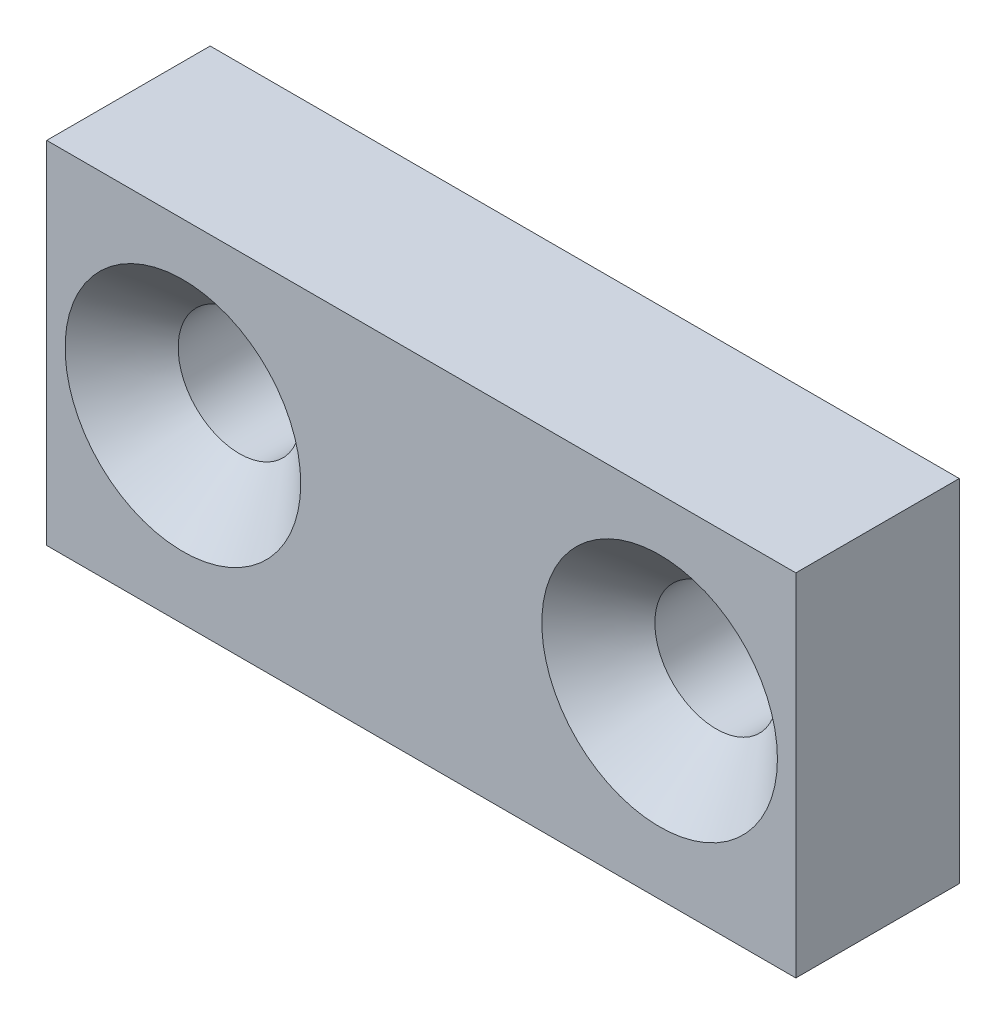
ISO-10303-21;
HEADER;
FILE_DESCRIPTION(('STEP AP214'),'2;1');
FILE_NAME('part.step','',(''),(''),'','','');
FILE_SCHEMA(('AUTOMOTIVE_DESIGN { 1 0 10303 214 1 1 1 1 }'));
ENDSEC;
DATA;
#1=APPLICATION_CONTEXT('core data for automotive mechanical design processes');
#2=APPLICATION_PROTOCOL_DEFINITION('international standard','automotive_design',2000,#1);
#3=PRODUCT_CONTEXT('',#1,'mechanical');
#4=PRODUCT('Part','Part','',(#3));
#5=PRODUCT_RELATED_PRODUCT_CATEGORY('part','',(#4));
#6=PRODUCT_DEFINITION_FORMATION('','',#4);
#7=PRODUCT_DEFINITION_CONTEXT('part definition',#1,'design');
#8=PRODUCT_DEFINITION('design','',#6,#7);
#9=PRODUCT_DEFINITION_SHAPE('','',#8);
#10=(LENGTH_UNIT() NAMED_UNIT(*) SI_UNIT(.MILLI.,.METRE.));
#11=(NAMED_UNIT(*) PLANE_ANGLE_UNIT() SI_UNIT($,.RADIAN.));
#12=(NAMED_UNIT(*) SI_UNIT($,.STERADIAN.) SOLID_ANGLE_UNIT());
#13=UNCERTAINTY_MEASURE_WITH_UNIT(LENGTH_MEASURE(1.E-05),#10,'distance_accuracy_value','');
#14=(GEOMETRIC_REPRESENTATION_CONTEXT(3) GLOBAL_UNCERTAINTY_ASSIGNED_CONTEXT((#13)) GLOBAL_UNIT_ASSIGNED_CONTEXT((#10,
#11,#12)) REPRESENTATION_CONTEXT('',''));
#15=CARTESIAN_POINT('',(0.,0.,0.));
#16=DIRECTION('',(0.,0.,1.));
#17=DIRECTION('',(1.,0.,0.));
#18=AXIS2_PLACEMENT_3D('',#15,#16,#17);
#19=CARTESIAN_POINT('',(-598.,0.,72.7336611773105));
#20=DIRECTION('',(1.,0.,0.));
#21=DIRECTION('',(0.,0.,-1.));
#22=AXIS2_PLACEMENT_3D('',#19,#20,#21);
#23=PLANE('',#22);
#24=DIRECTION('',(0.,-1.,0.));
#25=VECTOR('',#24,1.);
#26=CARTESIAN_POINT('',(-598.,0.,12.0000000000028));
#27=LINE('',#26,#25);
#28=CARTESIAN_POINT('',(-598.,25.76,12.0000000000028));
#29=VERTEX_POINT('',#28);
#30=CARTESIAN_POINT('',(-598.,0.,12.0000000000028));
#31=VERTEX_POINT('',#30);
#32=EDGE_CURVE('E81',#29,#31,#27,.T.);
#33=ORIENTED_EDGE('',*,*,#32,.F.);
#34=DIRECTION('',(0.,0.,-1.));
#35=VECTOR('',#34,1.);
#36=CARTESIAN_POINT('',(-598.,25.76,72.7336611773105));
#37=LINE('',#36,#35);
#38=CARTESIAN_POINT('',(-598.,25.76,0.));
#39=VERTEX_POINT('',#38);
#40=EDGE_CURVE('E35',#29,#39,#37,.T.);
#41=ORIENTED_EDGE('',*,*,#40,.T.);
#42=DIRECTION('',(0.,-1.,0.));
#43=VECTOR('',#42,1.);
#44=CARTESIAN_POINT('',(-598.,0.,0.));
#45=LINE('',#44,#43);
#46=CARTESIAN_POINT('',(-598.,0.,0.));
#47=VERTEX_POINT('',#46);
#48=EDGE_CURVE('E79',#39,#47,#45,.T.);
#49=ORIENTED_EDGE('',*,*,#48,.T.);
#50=DIRECTION('',(0.,0.,-1.));
#51=VECTOR('',#50,1.);
#52=CARTESIAN_POINT('',(-598.,0.,72.7336611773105));
#53=LINE('',#52,#51);
#54=EDGE_CURVE('E70',#31,#47,#53,.T.);
#55=ORIENTED_EDGE('',*,*,#54,.F.);
#56=EDGE_LOOP('',(#33,#41,#49,#55));
#57=FACE_BOUND('',#56,.T.);
#58=ADVANCED_FACE('F31',(#57),#23,.F.);
#59=CARTESIAN_POINT('',(-543.,0.,72.7336611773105));
#60=DIRECTION('',(0.,1.,0.));
#61=DIRECTION('',(-1.,0.,0.));
#62=AXIS2_PLACEMENT_3D('',#59,#60,#61);
#63=PLANE('',#62);
#64=DIRECTION('',(1.,0.,0.));
#65=VECTOR('',#64,1.);
#66=CARTESIAN_POINT('',(-543.,0.,12.0000000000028));
#67=LINE('',#66,#65);
#68=CARTESIAN_POINT('',(-543.,0.,12.0000000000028));
#69=VERTEX_POINT('',#68);
#70=EDGE_CURVE('E40',#31,#69,#67,.T.);
#71=ORIENTED_EDGE('',*,*,#70,.F.);
#72=ORIENTED_EDGE('',*,*,#54,.T.);
#73=DIRECTION('',(1.,0.,0.));
#74=VECTOR('',#73,1.);
#75=CARTESIAN_POINT('',(-543.,0.,0.));
#76=LINE('',#75,#74);
#77=CARTESIAN_POINT('',(-543.,0.,0.));
#78=VERTEX_POINT('',#77);
#79=EDGE_CURVE('E92',#47,#78,#76,.T.);
#80=ORIENTED_EDGE('',*,*,#79,.T.);
#81=DIRECTION('',(0.,0.,-1.));
#82=VECTOR('',#81,1.);
#83=CARTESIAN_POINT('',(-543.,0.,72.7336611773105));
#84=LINE('',#83,#82);
#85=EDGE_CURVE('E101',#69,#78,#84,.T.);
#86=ORIENTED_EDGE('',*,*,#85,.F.);
#87=EDGE_LOOP('',(#71,#72,#80,#86));
#88=FACE_BOUND('',#87,.T.);
#89=ADVANCED_FACE('F144',(#88),#63,.F.);
#90=CARTESIAN_POINT('',(-543.,0.,72.7336611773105));
#91=DIRECTION('',(-1.,0.,0.));
#92=DIRECTION('',(0.,0.,1.));
#93=AXIS2_PLACEMENT_3D('',#90,#91,#92);
#94=PLANE('',#93);
#95=DIRECTION('',(0.,1.,0.));
#96=VECTOR('',#95,1.);
#97=CARTESIAN_POINT('',(-543.,0.,12.0000000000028));
#98=LINE('',#97,#96);
#99=CARTESIAN_POINT('',(-543.,25.76,12.0000000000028));
#100=VERTEX_POINT('',#99);
#101=EDGE_CURVE('E11',#69,#100,#98,.T.);
#102=ORIENTED_EDGE('',*,*,#101,.F.);
#103=ORIENTED_EDGE('',*,*,#85,.T.);
#104=DIRECTION('',(0.,1.,0.));
#105=VECTOR('',#104,1.);
#106=CARTESIAN_POINT('',(-543.,0.,0.));
#107=LINE('',#106,#105);
#108=CARTESIAN_POINT('',(-543.,25.76,0.));
#109=VERTEX_POINT('',#108);
#110=EDGE_CURVE('E102',#78,#109,#107,.T.);
#111=ORIENTED_EDGE('',*,*,#110,.T.);
#112=DIRECTION('',(0.,0.,-1.));
#113=VECTOR('',#112,1.);
#114=CARTESIAN_POINT('',(-543.,25.76,72.7336611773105));
#115=LINE('',#114,#113);
#116=EDGE_CURVE('E53',#100,#109,#115,.T.);
#117=ORIENTED_EDGE('',*,*,#116,.F.);
#118=EDGE_LOOP('',(#102,#103,#111,#117));
#119=FACE_BOUND('',#118,.T.);
#120=ADVANCED_FACE('F143',(#119),#94,.F.);
#121=CARTESIAN_POINT('',(-543.,25.76,72.7336611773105));
#122=DIRECTION('',(0.,-1.,0.));
#123=DIRECTION('',(0.,0.,-1.));
#124=AXIS2_PLACEMENT_3D('',#121,#122,#123);
#125=PLANE('',#124);
#126=DIRECTION('',(-1.,0.,0.));
#127=VECTOR('',#126,1.);
#128=CARTESIAN_POINT('',(-543.,25.76,12.0000000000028));
#129=LINE('',#128,#127);
#130=EDGE_CURVE('E89',#100,#29,#129,.T.);
#131=ORIENTED_EDGE('',*,*,#130,.F.);
#132=ORIENTED_EDGE('',*,*,#116,.T.);
#133=DIRECTION('',(-1.,0.,0.));
#134=VECTOR('',#133,1.);
#135=CARTESIAN_POINT('',(-543.,25.76,0.));
#136=LINE('',#135,#134);
#137=EDGE_CURVE('E85',#109,#39,#136,.T.);
#138=ORIENTED_EDGE('',*,*,#137,.T.);
#139=ORIENTED_EDGE('',*,*,#40,.F.);
#140=EDGE_LOOP('',(#131,#132,#138,#139));
#141=FACE_BOUND('',#140,.T.);
#142=ADVANCED_FACE('F86',(#141),#125,.F.);
#143=CARTESIAN_POINT('',(-598.,25.76,0.));
#144=DIRECTION('',(0.,0.,1.));
#145=DIRECTION('',(1.,0.,0.));
#146=AXIS2_PLACEMENT_3D('',#143,#144,#145);
#147=PLANE('',#146);
#148=CARTESIAN_POINT('',(-553.,13.26,0.));
#149=DIRECTION('',(0.,0.,1.));
#150=DIRECTION('',(1.,0.,0.));
#151=AXIS2_PLACEMENT_3D('',#148,#149,#150);
#152=CIRCLE('',#151,4.49999999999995);
#153=CARTESIAN_POINT('',(-548.5,13.26,0.));
#154=VERTEX_POINT('',#153);
#155=EDGE_CURVE('E119',#154,#154,#152,.T.);
#156=ORIENTED_EDGE('',*,*,#155,.T.);
#157=EDGE_LOOP('',(#156));
#158=FACE_BOUND('',#157,.T.);
#159=CARTESIAN_POINT('',(-588.,13.26,0.));
#160=DIRECTION('',(0.,0.,1.));
#161=DIRECTION('',(1.,0.,0.));
#162=AXIS2_PLACEMENT_3D('',#159,#160,#161);
#163=CIRCLE('',#162,4.49999999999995);
#164=CARTESIAN_POINT('',(-583.5,13.26,0.));
#165=VERTEX_POINT('',#164);
#166=EDGE_CURVE('E110',#165,#165,#163,.T.);
#167=ORIENTED_EDGE('',*,*,#166,.T.);
#168=EDGE_LOOP('',(#167));
#169=FACE_BOUND('',#168,.T.);
#170=ORIENTED_EDGE('',*,*,#48,.F.);
#171=ORIENTED_EDGE('',*,*,#137,.F.);
#172=ORIENTED_EDGE('',*,*,#110,.F.);
#173=ORIENTED_EDGE('',*,*,#79,.F.);
#174=EDGE_LOOP('',(#170,#171,#172,#173));
#175=FACE_BOUND('',#174,.T.);
#176=ADVANCED_FACE('F91',(#158,#169,#175),#147,.F.);
#177=CARTESIAN_POINT('',(-568.,3.64999999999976,12.0000000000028));
#178=DIRECTION('',(0.,0.,1.));
#179=DIRECTION('',(1.,0.,0.));
#180=AXIS2_PLACEMENT_3D('',#177,#178,#179);
#181=PLANE('',#180);
#182=CARTESIAN_POINT('',(-553.,13.26,12.0000000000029));
#183=DIRECTION('',(0.,0.,1.));
#184=DIRECTION('',(1.,0.,0.));
#185=AXIS2_PLACEMENT_3D('',#182,#183,#184);
#186=CIRCLE('',#185,8.65000000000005);
#187=CARTESIAN_POINT('',(-544.35,13.26,12.0000000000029));
#188=VERTEX_POINT('',#187);
#189=EDGE_CURVE('E113',#188,#188,#186,.T.);
#190=ORIENTED_EDGE('',*,*,#189,.F.);
#191=EDGE_LOOP('',(#190));
#192=FACE_BOUND('',#191,.T.);
#193=CARTESIAN_POINT('',(-588.,13.26,12.0000000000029));
#194=DIRECTION('',(0.,0.,1.));
#195=DIRECTION('',(1.,0.,0.));
#196=AXIS2_PLACEMENT_3D('',#193,#194,#195);
#197=CIRCLE('',#196,8.65000000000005);
#198=CARTESIAN_POINT('',(-579.35,13.26,12.0000000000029));
#199=VERTEX_POINT('',#198);
#200=EDGE_CURVE('E83',#199,#199,#197,.T.);
#201=ORIENTED_EDGE('',*,*,#200,.F.);
#202=EDGE_LOOP('',(#201));
#203=FACE_BOUND('',#202,.T.);
#204=ORIENTED_EDGE('',*,*,#130,.T.);
#205=ORIENTED_EDGE('',*,*,#32,.T.);
#206=ORIENTED_EDGE('',*,*,#70,.T.);
#207=ORIENTED_EDGE('',*,*,#101,.T.);
#208=EDGE_LOOP('',(#204,#205,#206,#207));
#209=FACE_BOUND('',#208,.T.);
#210=ADVANCED_FACE('F33',(#192,#203,#209),#181,.T.);
#211=CARTESIAN_POINT('',(-588.,13.26,12.0000000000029));
#212=DIRECTION('',(0.,0.,1.));
#213=DIRECTION('',(1.,0.,0.));
#214=AXIS2_PLACEMENT_3D('',#211,#212,#213);
#215=CONICAL_SURFACE('',#214,8.65000000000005,0.78539816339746);
#216=CARTESIAN_POINT('',(-588.,13.26,7.8500000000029));
#217=DIRECTION('',(0.,0.,1.));
#218=DIRECTION('',(1.,0.,0.));
#219=AXIS2_PLACEMENT_3D('',#216,#217,#218);
#220=CIRCLE('',#219,4.49999999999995);
#221=CARTESIAN_POINT('',(-583.5,13.26,7.8500000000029));
#222=VERTEX_POINT('',#221);
#223=EDGE_CURVE('E107',#222,#222,#220,.T.);
#224=ORIENTED_EDGE('',*,*,#223,.F.);
#225=EDGE_LOOP('',(#224));
#226=FACE_BOUND('',#225,.T.);
#227=ORIENTED_EDGE('',*,*,#200,.T.);
#228=EDGE_LOOP('',(#227));
#229=FACE_BOUND('',#228,.T.);
#230=ADVANCED_FACE('F140',(#226,#229),#215,.F.);
#231=CARTESIAN_POINT('',(-588.,13.26,12.0000000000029));
#232=DIRECTION('',(0.,0.,1.));
#233=DIRECTION('',(1.,0.,0.));
#234=AXIS2_PLACEMENT_3D('',#231,#232,#233);
#235=CYLINDRICAL_SURFACE('',#234,4.49999999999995);
#236=ORIENTED_EDGE('',*,*,#166,.F.);
#237=EDGE_LOOP('',(#236));
#238=FACE_BOUND('',#237,.T.);
#239=ORIENTED_EDGE('',*,*,#223,.T.);
#240=EDGE_LOOP('',(#239));
#241=FACE_BOUND('',#240,.T.);
#242=ADVANCED_FACE('F134',(#238,#241),#235,.F.);
#243=CARTESIAN_POINT('',(-553.,13.26,12.0000000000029));
#244=DIRECTION('',(0.,0.,1.));
#245=DIRECTION('',(1.,0.,0.));
#246=AXIS2_PLACEMENT_3D('',#243,#244,#245);
#247=CONICAL_SURFACE('',#246,8.65000000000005,0.78539816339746);
#248=CARTESIAN_POINT('',(-553.,13.26,7.8500000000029));
#249=DIRECTION('',(0.,0.,1.));
#250=DIRECTION('',(1.,0.,0.));
#251=AXIS2_PLACEMENT_3D('',#248,#249,#250);
#252=CIRCLE('',#251,4.49999999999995);
#253=CARTESIAN_POINT('',(-548.5,13.26,7.8500000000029));
#254=VERTEX_POINT('',#253);
#255=EDGE_CURVE('E116',#254,#254,#252,.T.);
#256=ORIENTED_EDGE('',*,*,#255,.F.);
#257=EDGE_LOOP('',(#256));
#258=FACE_BOUND('',#257,.T.);
#259=ORIENTED_EDGE('',*,*,#189,.T.);
#260=EDGE_LOOP('',(#259));
#261=FACE_BOUND('',#260,.T.);
#262=ADVANCED_FACE('F128',(#258,#261),#247,.F.);
#263=CARTESIAN_POINT('',(-553.,13.26,12.0000000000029));
#264=DIRECTION('',(0.,0.,1.));
#265=DIRECTION('',(1.,0.,0.));
#266=AXIS2_PLACEMENT_3D('',#263,#264,#265);
#267=CYLINDRICAL_SURFACE('',#266,4.49999999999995);
#268=ORIENTED_EDGE('',*,*,#155,.F.);
#269=EDGE_LOOP('',(#268));
#270=FACE_BOUND('',#269,.T.);
#271=ORIENTED_EDGE('',*,*,#255,.T.);
#272=EDGE_LOOP('',(#271));
#273=FACE_BOUND('',#272,.T.);
#274=ADVANCED_FACE('F125',(#270,#273),#267,.F.);
#275=CLOSED_SHELL('',(#58,#89,#120,#142,#176,#210,#230,#242,#262,#274));
#276=MANIFOLD_SOLID_BREP('B2',#275);
#277=ADVANCED_BREP_SHAPE_REPRESENTATION('',(#18,#276),#14);
#278=SHAPE_DEFINITION_REPRESENTATION(#9,#277);
ENDSEC;
END-ISO-10303-21;
